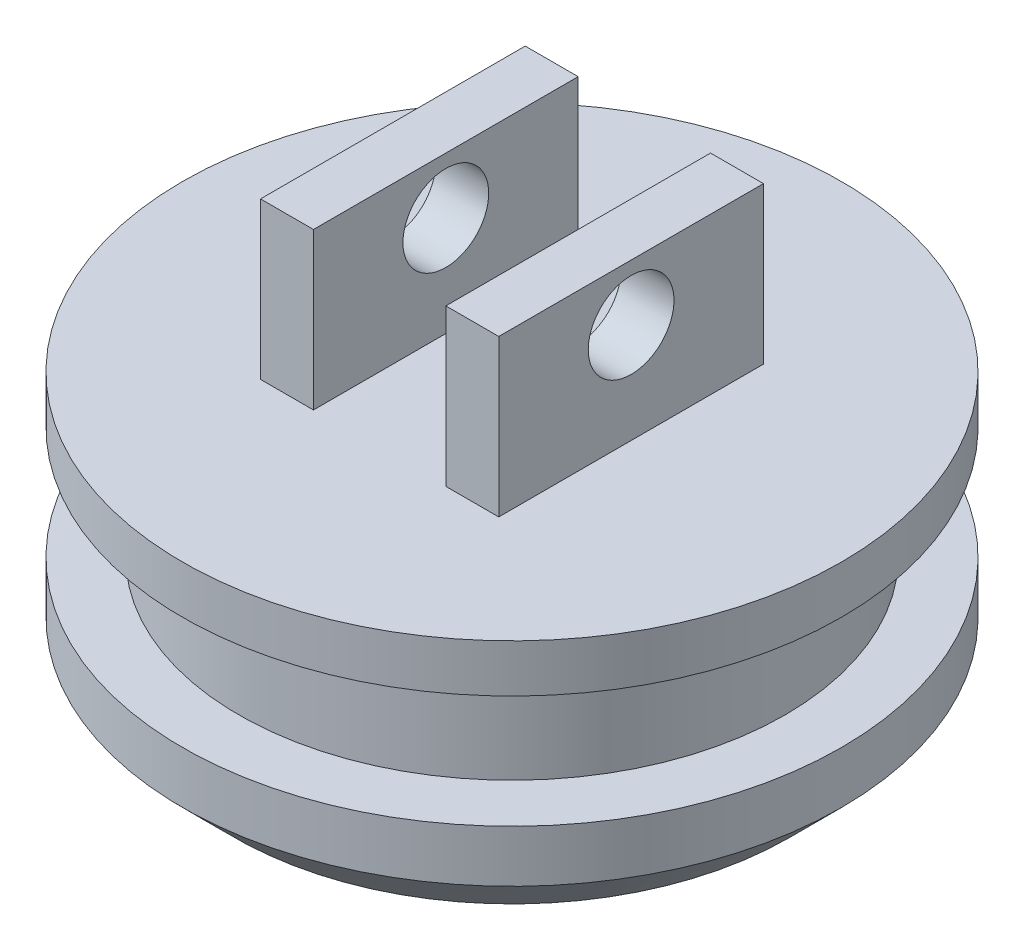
ISO-10303-21;
HEADER;
FILE_DESCRIPTION(('STEP AP214'),'2;1');
FILE_NAME('part.step','',(''),(''),'','','');
FILE_SCHEMA(('AUTOMOTIVE_DESIGN { 1 0 10303 214 1 1 1 1 }'));
ENDSEC;
DATA;
#1=APPLICATION_CONTEXT('core data for automotive mechanical design processes');
#2=APPLICATION_PROTOCOL_DEFINITION('international standard','automotive_design',2000,#1);
#3=PRODUCT_CONTEXT('',#1,'mechanical');
#4=PRODUCT('Part','Part','',(#3));
#5=PRODUCT_RELATED_PRODUCT_CATEGORY('part','',(#4));
#6=PRODUCT_DEFINITION_FORMATION('','',#4);
#7=PRODUCT_DEFINITION_CONTEXT('part definition',#1,'design');
#8=PRODUCT_DEFINITION('design','',#6,#7);
#9=PRODUCT_DEFINITION_SHAPE('','',#8);
#10=(LENGTH_UNIT() NAMED_UNIT(*) SI_UNIT(.MILLI.,.METRE.));
#11=(NAMED_UNIT(*) PLANE_ANGLE_UNIT() SI_UNIT($,.RADIAN.));
#12=(NAMED_UNIT(*) SI_UNIT($,.STERADIAN.) SOLID_ANGLE_UNIT());
#13=UNCERTAINTY_MEASURE_WITH_UNIT(LENGTH_MEASURE(1.E-05),#10,'distance_accuracy_value','');
#14=(GEOMETRIC_REPRESENTATION_CONTEXT(3) GLOBAL_UNCERTAINTY_ASSIGNED_CONTEXT((#13)) GLOBAL_UNIT_ASSIGNED_CONTEXT((#10,
#11,#12)) REPRESENTATION_CONTEXT('',''));
#15=CARTESIAN_POINT('',(0.,0.,0.));
#16=DIRECTION('',(0.,0.,1.));
#17=DIRECTION('',(1.,0.,0.));
#18=AXIS2_PLACEMENT_3D('',#15,#16,#17);
#19=CARTESIAN_POINT('',(5.715,11.7920074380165,-6.35));
#20=DIRECTION('',(1.,0.,0.));
#21=DIRECTION('',(0.,0.,-1.));
#22=AXIS2_PLACEMENT_3D('',#19,#20,#21);
#23=PLANE('',#22);
#24=DIRECTION('',(0.,0.,1.));
#25=VECTOR('',#24,1.);
#26=CARTESIAN_POINT('',(5.715,4.29200743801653,-6.35));
#27=LINE('',#26,#25);
#28=CARTESIAN_POINT('',(5.715,4.29200743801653,-6.35));
#29=VERTEX_POINT('',#28);
#30=CARTESIAN_POINT('',(5.715,4.29200743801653,6.35));
#31=VERTEX_POINT('',#30);
#32=EDGE_CURVE('E104',#29,#31,#27,.T.);
#33=ORIENTED_EDGE('',*,*,#32,.F.);
#34=DIRECTION('',(0.,-1.,0.));
#35=VECTOR('',#34,1.);
#36=CARTESIAN_POINT('',(5.715,11.7920074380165,-6.35));
#37=LINE('',#36,#35);
#38=CARTESIAN_POINT('',(5.715,11.7920074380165,-6.35));
#39=VERTEX_POINT('',#38);
#40=EDGE_CURVE('E98',#39,#29,#37,.T.);
#41=ORIENTED_EDGE('',*,*,#40,.F.);
#42=DIRECTION('',(0.,0.,1.));
#43=VECTOR('',#42,1.);
#44=CARTESIAN_POINT('',(5.715,11.7920074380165,-6.35));
#45=LINE('',#44,#43);
#46=CARTESIAN_POINT('',(5.715,11.7920074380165,6.35));
#47=VERTEX_POINT('',#46);
#48=EDGE_CURVE('E101',#39,#47,#45,.T.);
#49=ORIENTED_EDGE('',*,*,#48,.T.);
#50=DIRECTION('',(0.,-1.,0.));
#51=VECTOR('',#50,1.);
#52=CARTESIAN_POINT('',(5.715,11.7920074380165,6.35));
#53=LINE('',#52,#51);
#54=EDGE_CURVE('E129',#47,#31,#53,.T.);
#55=ORIENTED_EDGE('',*,*,#54,.T.);
#56=EDGE_LOOP('',(#33,#41,#49,#55));
#57=FACE_BOUND('',#56,.T.);
#58=CARTESIAN_POINT('',(5.715,9.09400743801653,0.));
#59=DIRECTION('',(-1.,0.,0.));
#60=DIRECTION('',(0.,0.,1.));
#61=AXIS2_PLACEMENT_3D('',#58,#59,#60);
#62=CIRCLE('',#61,2.0574);
#63=CARTESIAN_POINT('',(5.715,9.09400743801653,2.0574));
#64=VERTEX_POINT('',#63);
#65=EDGE_CURVE('E192',#64,#64,#62,.T.);
#66=ORIENTED_EDGE('',*,*,#65,.T.);
#67=EDGE_LOOP('',(#66));
#68=FACE_BOUND('',#67,.T.);
#69=ADVANCED_FACE('F33',(#57,#68),#23,.T.);
#70=CARTESIAN_POINT('',(3.175,11.7920074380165,-6.35));
#71=DIRECTION('',(-1.,0.,0.));
#72=DIRECTION('',(0.,0.,1.));
#73=AXIS2_PLACEMENT_3D('',#70,#71,#72);
#74=PLANE('',#73);
#75=DIRECTION('',(0.,0.,-1.));
#76=VECTOR('',#75,1.);
#77=CARTESIAN_POINT('',(3.175,4.29200743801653,-6.35));
#78=LINE('',#77,#76);
#79=CARTESIAN_POINT('',(3.175,4.29200743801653,6.35));
#80=VERTEX_POINT('',#79);
#81=CARTESIAN_POINT('',(3.175,4.29200743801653,-6.35));
#82=VERTEX_POINT('',#81);
#83=EDGE_CURVE('E48',#80,#82,#78,.T.);
#84=ORIENTED_EDGE('',*,*,#83,.F.);
#85=DIRECTION('',(0.,-1.,0.));
#86=VECTOR('',#85,1.);
#87=CARTESIAN_POINT('',(3.175,11.7920074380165,6.35));
#88=LINE('',#87,#86);
#89=CARTESIAN_POINT('',(3.175,11.7920074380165,6.35));
#90=VERTEX_POINT('',#89);
#91=EDGE_CURVE('E138',#90,#80,#88,.T.);
#92=ORIENTED_EDGE('',*,*,#91,.F.);
#93=DIRECTION('',(0.,0.,-1.));
#94=VECTOR('',#93,1.);
#95=CARTESIAN_POINT('',(3.175,11.7920074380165,-6.35));
#96=LINE('',#95,#94);
#97=CARTESIAN_POINT('',(3.175,11.7920074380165,-6.35));
#98=VERTEX_POINT('',#97);
#99=EDGE_CURVE('E123',#90,#98,#96,.T.);
#100=ORIENTED_EDGE('',*,*,#99,.T.);
#101=DIRECTION('',(0.,-1.,0.));
#102=VECTOR('',#101,1.);
#103=CARTESIAN_POINT('',(3.175,11.7920074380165,-6.35));
#104=LINE('',#103,#102);
#105=EDGE_CURVE('E110',#98,#82,#104,.T.);
#106=ORIENTED_EDGE('',*,*,#105,.T.);
#107=EDGE_LOOP('',(#84,#92,#100,#106));
#108=FACE_BOUND('',#107,.T.);
#109=CARTESIAN_POINT('',(3.175,9.09400743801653,0.));
#110=DIRECTION('',(-1.,0.,0.));
#111=DIRECTION('',(0.,0.,1.));
#112=AXIS2_PLACEMENT_3D('',#109,#110,#111);
#113=CIRCLE('',#112,2.0574);
#114=CARTESIAN_POINT('',(3.175,9.09400743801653,2.0574));
#115=VERTEX_POINT('',#114);
#116=EDGE_CURVE('E132',#115,#115,#113,.F.);
#117=ORIENTED_EDGE('',*,*,#116,.T.);
#118=EDGE_LOOP('',(#117));
#119=FACE_BOUND('',#118,.T.);
#120=ADVANCED_FACE('F208',(#108,#119),#74,.T.);
#121=CARTESIAN_POINT('',(0.,4.29200743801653,0.));
#122=DIRECTION('',(0.,-1.,0.));
#123=DIRECTION('',(1.,0.,0.));
#124=AXIS2_PLACEMENT_3D('',#121,#122,#123);
#125=PLANE('',#124);
#126=DIRECTION('',(1.,0.,0.));
#127=VECTOR('',#126,1.);
#128=CARTESIAN_POINT('',(5.715,4.29200743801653,-6.35));
#129=LINE('',#128,#127);
#130=EDGE_CURVE('E131',#82,#29,#129,.T.);
#131=ORIENTED_EDGE('',*,*,#130,.T.);
#132=ORIENTED_EDGE('',*,*,#32,.T.);
#133=DIRECTION('',(-1.,0.,0.));
#134=VECTOR('',#133,1.);
#135=CARTESIAN_POINT('',(5.715,4.29200743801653,6.35));
#136=LINE('',#135,#134);
#137=EDGE_CURVE('E120',#31,#80,#136,.T.);
#138=ORIENTED_EDGE('',*,*,#137,.T.);
#139=ORIENTED_EDGE('',*,*,#83,.T.);
#140=EDGE_LOOP('',(#131,#132,#138,#139));
#141=FACE_BOUND('',#140,.T.);
#142=CARTESIAN_POINT('',(0.,4.29200743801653,0.));
#143=DIRECTION('',(0.,-1.,0.));
#144=DIRECTION('',(1.,0.,0.));
#145=AXIS2_PLACEMENT_3D('',#142,#143,#144);
#146=CIRCLE('',#145,15.8115);
#147=CARTESIAN_POINT('',(15.8115,4.29200743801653,0.));
#148=VERTEX_POINT('',#147);
#149=EDGE_CURVE('E186',#148,#148,#146,.T.);
#150=ORIENTED_EDGE('',*,*,#149,.F.);
#151=EDGE_LOOP('',(#150));
#152=FACE_BOUND('',#151,.T.);
#153=DIRECTION('',(0.,0.,1.));
#154=VECTOR('',#153,1.);
#155=CARTESIAN_POINT('',(-5.715,4.29200743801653,-6.35));
#156=LINE('',#155,#154);
#157=CARTESIAN_POINT('',(-5.715,4.29200743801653,-6.35));
#158=VERTEX_POINT('',#157);
#159=CARTESIAN_POINT('',(-5.715,4.29200743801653,6.35));
#160=VERTEX_POINT('',#159);
#161=EDGE_CURVE('E155',#158,#160,#156,.T.);
#162=ORIENTED_EDGE('',*,*,#161,.F.);
#163=DIRECTION('',(-1.,0.,0.));
#164=VECTOR('',#163,1.);
#165=CARTESIAN_POINT('',(-5.715,4.29200743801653,-6.35));
#166=LINE('',#165,#164);
#167=CARTESIAN_POINT('',(-3.175,4.29200743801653,-6.35));
#168=VERTEX_POINT('',#167);
#169=EDGE_CURVE('E148',#168,#158,#166,.T.);
#170=ORIENTED_EDGE('',*,*,#169,.F.);
#171=DIRECTION('',(0.,0.,-1.));
#172=VECTOR('',#171,1.);
#173=CARTESIAN_POINT('',(-3.175,4.29200743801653,-6.35));
#174=LINE('',#173,#172);
#175=CARTESIAN_POINT('',(-3.175,4.29200743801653,6.35));
#176=VERTEX_POINT('',#175);
#177=EDGE_CURVE('E159',#176,#168,#174,.T.);
#178=ORIENTED_EDGE('',*,*,#177,.F.);
#179=DIRECTION('',(1.,0.,0.));
#180=VECTOR('',#179,1.);
#181=CARTESIAN_POINT('',(-5.715,4.29200743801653,6.35));
#182=LINE('',#181,#180);
#183=EDGE_CURVE('E56',#160,#176,#182,.T.);
#184=ORIENTED_EDGE('',*,*,#183,.F.);
#185=EDGE_LOOP('',(#162,#170,#178,#184));
#186=FACE_BOUND('',#185,.T.);
#187=ADVANCED_FACE('F213',(#141,#152,#186),#125,.F.);
#188=CARTESIAN_POINT('',(0.,-8.40799256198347,0.));
#189=DIRECTION('',(0.,-1.,0.));
#190=DIRECTION('',(1.,0.,0.));
#191=AXIS2_PLACEMENT_3D('',#188,#189,#190);
#192=CYLINDRICAL_SURFACE('',#191,15.8115);
#193=CARTESIAN_POINT('',(0.,1.99710743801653,0.));
#194=DIRECTION('',(0.,-1.,0.));
#195=DIRECTION('',(1.,0.,0.));
#196=AXIS2_PLACEMENT_3D('',#193,#194,#195);
#197=CIRCLE('',#196,15.8115);
#198=CARTESIAN_POINT('',(15.8115,1.99710743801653,0.));
#199=VERTEX_POINT('',#198);
#200=EDGE_CURVE('E183',#199,#199,#197,.T.);
#201=ORIENTED_EDGE('',*,*,#200,.F.);
#202=EDGE_LOOP('',(#201));
#203=FACE_BOUND('',#202,.T.);
#204=ORIENTED_EDGE('',*,*,#149,.T.);
#205=EDGE_LOOP('',(#204));
#206=FACE_BOUND('',#205,.T.);
#207=ADVANCED_FACE('F258',(#203,#206),#192,.T.);
#208=CARTESIAN_POINT('',(-15.8115,1.99710743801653,0.));
#209=DIRECTION('',(0.,1.,0.));
#210=DIRECTION('',(-1.,0.,0.));
#211=AXIS2_PLACEMENT_3D('',#208,#209,#210);
#212=PLANE('',#211);
#213=CARTESIAN_POINT('',(0.,1.99710743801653,0.));
#214=DIRECTION('',(0.,-1.,0.));
#215=DIRECTION('',(1.,0.,0.));
#216=AXIS2_PLACEMENT_3D('',#213,#214,#215);
#217=CIRCLE('',#216,13.1064);
#218=CARTESIAN_POINT('',(13.1064,1.99710743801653,0.));
#219=VERTEX_POINT('',#218);
#220=EDGE_CURVE('E180',#219,#219,#217,.T.);
#221=ORIENTED_EDGE('',*,*,#220,.F.);
#222=EDGE_LOOP('',(#221));
#223=FACE_BOUND('',#222,.T.);
#224=ORIENTED_EDGE('',*,*,#200,.T.);
#225=EDGE_LOOP('',(#224));
#226=FACE_BOUND('',#225,.T.);
#227=ADVANCED_FACE('F254',(#223,#226),#212,.F.);
#228=CARTESIAN_POINT('',(0.,-8.40799256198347,0.));
#229=DIRECTION('',(0.,-1.,0.));
#230=DIRECTION('',(1.,0.,0.));
#231=AXIS2_PLACEMENT_3D('',#228,#229,#230);
#232=CYLINDRICAL_SURFACE('',#231,13.1064);
#233=CARTESIAN_POINT('',(0.,-3.41309256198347,0.));
#234=DIRECTION('',(0.,-1.,0.));
#235=DIRECTION('',(1.,0.,0.));
#236=AXIS2_PLACEMENT_3D('',#233,#234,#235);
#237=CIRCLE('',#236,13.1064);
#238=CARTESIAN_POINT('',(13.1064,-3.41309256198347,0.));
#239=VERTEX_POINT('',#238);
#240=EDGE_CURVE('E177',#239,#239,#237,.T.);
#241=ORIENTED_EDGE('',*,*,#240,.F.);
#242=EDGE_LOOP('',(#241));
#243=FACE_BOUND('',#242,.T.);
#244=ORIENTED_EDGE('',*,*,#220,.T.);
#245=EDGE_LOOP('',(#244));
#246=FACE_BOUND('',#245,.T.);
#247=ADVANCED_FACE('F250',(#243,#246),#232,.T.);
#248=CARTESIAN_POINT('',(-13.1064,-3.41309256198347,0.));
#249=DIRECTION('',(0.,-1.,0.));
#250=DIRECTION('',(1.,0.,0.));
#251=AXIS2_PLACEMENT_3D('',#248,#249,#250);
#252=PLANE('',#251);
#253=CARTESIAN_POINT('',(0.,-3.41309256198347,0.));
#254=DIRECTION('',(0.,-1.,0.));
#255=DIRECTION('',(1.,0.,0.));
#256=AXIS2_PLACEMENT_3D('',#253,#254,#255);
#257=CIRCLE('',#256,15.8115);
#258=CARTESIAN_POINT('',(15.8115,-3.41309256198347,0.));
#259=VERTEX_POINT('',#258);
#260=EDGE_CURVE('E174',#259,#259,#257,.T.);
#261=ORIENTED_EDGE('',*,*,#260,.F.);
#262=EDGE_LOOP('',(#261));
#263=FACE_BOUND('',#262,.T.);
#264=ORIENTED_EDGE('',*,*,#240,.T.);
#265=EDGE_LOOP('',(#264));
#266=FACE_BOUND('',#265,.T.);
#267=ADVANCED_FACE('F246',(#263,#266),#252,.F.);
#268=CARTESIAN_POINT('',(0.,-8.40799256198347,0.));
#269=DIRECTION('',(0.,-1.,0.));
#270=DIRECTION('',(1.,0.,0.));
#271=AXIS2_PLACEMENT_3D('',#268,#269,#270);
#272=CYLINDRICAL_SURFACE('',#271,15.8115);
#273=CARTESIAN_POINT('',(0.,-5.90799256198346,0.));
#274=DIRECTION('',(0.,1.,0.));
#275=DIRECTION('',(-1.,0.,0.));
#276=AXIS2_PLACEMENT_3D('',#273,#274,#275);
#277=CIRCLE('',#276,15.8115);
#278=CARTESIAN_POINT('',(-15.8115,-5.90799256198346,0.));
#279=VERTEX_POINT('',#278);
#280=EDGE_CURVE('E11',#279,#279,#277,.T.);
#281=ORIENTED_EDGE('',*,*,#280,.T.);
#282=EDGE_LOOP('',(#281));
#283=FACE_BOUND('',#282,.T.);
#284=ORIENTED_EDGE('',*,*,#260,.T.);
#285=EDGE_LOOP('',(#284));
#286=FACE_BOUND('',#285,.T.);
#287=ADVANCED_FACE('F243',(#283,#286),#272,.T.);
#288=CARTESIAN_POINT('',(-15.8115,-8.40799256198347,0.));
#289=DIRECTION('',(0.,1.,0.));
#290=DIRECTION('',(-1.,0.,0.));
#291=AXIS2_PLACEMENT_3D('',#288,#289,#290);
#292=PLANE('',#291);
#293=CARTESIAN_POINT('',(0.,-8.40799256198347,0.));
#294=DIRECTION('',(0.,1.,0.));
#295=DIRECTION('',(-1.,0.,0.));
#296=AXIS2_PLACEMENT_3D('',#293,#294,#295);
#297=CIRCLE('',#296,13.3115);
#298=CARTESIAN_POINT('',(-13.3115,-8.40799256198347,0.));
#299=VERTEX_POINT('',#298);
#300=EDGE_CURVE('E41',#299,#299,#297,.F.);
#301=ORIENTED_EDGE('',*,*,#300,.T.);
#302=EDGE_LOOP('',(#301));
#303=FACE_BOUND('',#302,.T.);
#304=ADVANCED_FACE('F196',(#303),#292,.F.);
#305=CARTESIAN_POINT('',(-5.715,11.7920074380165,-6.35));
#306=DIRECTION('',(1.,0.,0.));
#307=DIRECTION('',(0.,0.,-1.));
#308=AXIS2_PLACEMENT_3D('',#305,#306,#307);
#309=PLANE('',#308);
#310=CARTESIAN_POINT('',(-5.715,9.09400743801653,0.));
#311=DIRECTION('',(-1.,0.,0.));
#312=DIRECTION('',(0.,0.,1.));
#313=AXIS2_PLACEMENT_3D('',#310,#311,#312);
#314=CIRCLE('',#313,2.0574);
#315=CARTESIAN_POINT('',(-5.715,9.09400743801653,2.0574));
#316=VERTEX_POINT('',#315);
#317=EDGE_CURVE('E109',#316,#316,#314,.T.);
#318=ORIENTED_EDGE('',*,*,#317,.F.);
#319=EDGE_LOOP('',(#318));
#320=FACE_BOUND('',#319,.T.);
#321=ORIENTED_EDGE('',*,*,#161,.T.);
#322=DIRECTION('',(0.,-1.,0.));
#323=VECTOR('',#322,1.);
#324=CARTESIAN_POINT('',(-5.715,11.7920074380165,6.35));
#325=LINE('',#324,#323);
#326=CARTESIAN_POINT('',(-5.715,11.7920074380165,6.35));
#327=VERTEX_POINT('',#326);
#328=EDGE_CURVE('E172',#327,#160,#325,.T.);
#329=ORIENTED_EDGE('',*,*,#328,.F.);
#330=DIRECTION('',(0.,0.,1.));
#331=VECTOR('',#330,1.);
#332=CARTESIAN_POINT('',(-5.715,11.7920074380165,-6.35));
#333=LINE('',#332,#331);
#334=CARTESIAN_POINT('',(-5.715,11.7920074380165,-6.35));
#335=VERTEX_POINT('',#334);
#336=EDGE_CURVE('E144',#335,#327,#333,.T.);
#337=ORIENTED_EDGE('',*,*,#336,.F.);
#338=DIRECTION('',(0.,-1.,0.));
#339=VECTOR('',#338,1.);
#340=CARTESIAN_POINT('',(-5.715,11.7920074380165,-6.35));
#341=LINE('',#340,#339);
#342=EDGE_CURVE('E154',#335,#158,#341,.T.);
#343=ORIENTED_EDGE('',*,*,#342,.T.);
#344=EDGE_LOOP('',(#321,#329,#337,#343));
#345=FACE_BOUND('',#344,.T.);
#346=ADVANCED_FACE('F236',(#320,#345),#309,.F.);
#347=CARTESIAN_POINT('',(-5.715,11.7920074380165,6.35));
#348=DIRECTION('',(0.,0.,-1.));
#349=DIRECTION('',(-1.,0.,0.));
#350=AXIS2_PLACEMENT_3D('',#347,#348,#349);
#351=PLANE('',#350);
#352=ORIENTED_EDGE('',*,*,#183,.T.);
#353=DIRECTION('',(0.,-1.,0.));
#354=VECTOR('',#353,1.);
#355=CARTESIAN_POINT('',(-3.175,11.7920074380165,6.35));
#356=LINE('',#355,#354);
#357=CARTESIAN_POINT('',(-3.175,11.7920074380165,6.35));
#358=VERTEX_POINT('',#357);
#359=EDGE_CURVE('E169',#358,#176,#356,.T.);
#360=ORIENTED_EDGE('',*,*,#359,.F.);
#361=DIRECTION('',(1.,0.,0.));
#362=VECTOR('',#361,1.);
#363=CARTESIAN_POINT('',(-5.715,11.7920074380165,6.35));
#364=LINE('',#363,#362);
#365=EDGE_CURVE('E147',#327,#358,#364,.T.);
#366=ORIENTED_EDGE('',*,*,#365,.F.);
#367=ORIENTED_EDGE('',*,*,#328,.T.);
#368=EDGE_LOOP('',(#352,#360,#366,#367));
#369=FACE_BOUND('',#368,.T.);
#370=ADVANCED_FACE('F232',(#369),#351,.F.);
#371=CARTESIAN_POINT('',(-3.175,11.7920074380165,-6.35));
#372=DIRECTION('',(-1.,0.,0.));
#373=DIRECTION('',(0.,0.,1.));
#374=AXIS2_PLACEMENT_3D('',#371,#372,#373);
#375=PLANE('',#374);
#376=CARTESIAN_POINT('',(-3.175,9.09400743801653,0.));
#377=DIRECTION('',(-1.,0.,0.));
#378=DIRECTION('',(0.,0.,1.));
#379=AXIS2_PLACEMENT_3D('',#376,#377,#378);
#380=CIRCLE('',#379,2.0574);
#381=CARTESIAN_POINT('',(-3.175,9.09400743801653,2.0574));
#382=VERTEX_POINT('',#381);
#383=EDGE_CURVE('E143',#382,#382,#380,.T.);
#384=ORIENTED_EDGE('',*,*,#383,.T.);
#385=EDGE_LOOP('',(#384));
#386=FACE_BOUND('',#385,.T.);
#387=ORIENTED_EDGE('',*,*,#177,.T.);
#388=DIRECTION('',(0.,-1.,0.));
#389=VECTOR('',#388,1.);
#390=CARTESIAN_POINT('',(-3.175,11.7920074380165,-6.35));
#391=LINE('',#390,#389);
#392=CARTESIAN_POINT('',(-3.175,11.7920074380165,-6.35));
#393=VERTEX_POINT('',#392);
#394=EDGE_CURVE('E166',#393,#168,#391,.T.);
#395=ORIENTED_EDGE('',*,*,#394,.F.);
#396=DIRECTION('',(0.,0.,-1.));
#397=VECTOR('',#396,1.);
#398=CARTESIAN_POINT('',(-3.175,11.7920074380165,-6.35));
#399=LINE('',#398,#397);
#400=EDGE_CURVE('E150',#358,#393,#399,.T.);
#401=ORIENTED_EDGE('',*,*,#400,.F.);
#402=ORIENTED_EDGE('',*,*,#359,.T.);
#403=EDGE_LOOP('',(#387,#395,#401,#402));
#404=FACE_BOUND('',#403,.T.);
#405=ADVANCED_FACE('F228',(#386,#404),#375,.F.);
#406=CARTESIAN_POINT('',(-5.715,11.7920074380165,-6.35));
#407=DIRECTION('',(0.,0.,1.));
#408=DIRECTION('',(1.,0.,0.));
#409=AXIS2_PLACEMENT_3D('',#406,#407,#408);
#410=PLANE('',#409);
#411=ORIENTED_EDGE('',*,*,#169,.T.);
#412=ORIENTED_EDGE('',*,*,#342,.F.);
#413=DIRECTION('',(-1.,0.,0.));
#414=VECTOR('',#413,1.);
#415=CARTESIAN_POINT('',(-5.715,11.7920074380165,-6.35));
#416=LINE('',#415,#414);
#417=EDGE_CURVE('E152',#393,#335,#416,.T.);
#418=ORIENTED_EDGE('',*,*,#417,.F.);
#419=ORIENTED_EDGE('',*,*,#394,.T.);
#420=EDGE_LOOP('',(#411,#412,#418,#419));
#421=FACE_BOUND('',#420,.T.);
#422=ADVANCED_FACE('F224',(#421),#410,.F.);
#423=CARTESIAN_POINT('',(0.,11.7920074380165,0.));
#424=DIRECTION('',(0.,1.,0.));
#425=DIRECTION('',(-1.,0.,0.));
#426=AXIS2_PLACEMENT_3D('',#423,#424,#425);
#427=PLANE('',#426);
#428=ORIENTED_EDGE('',*,*,#336,.T.);
#429=ORIENTED_EDGE('',*,*,#365,.T.);
#430=ORIENTED_EDGE('',*,*,#400,.T.);
#431=ORIENTED_EDGE('',*,*,#417,.T.);
#432=EDGE_LOOP('',(#428,#429,#430,#431));
#433=FACE_BOUND('',#432,.T.);
#434=ADVANCED_FACE('F220',(#433),#427,.T.);
#435=CARTESIAN_POINT('',(4.285,9.09400743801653,0.));
#436=DIRECTION('',(-1.,0.,0.));
#437=DIRECTION('',(0.,0.,1.));
#438=AXIS2_PLACEMENT_3D('',#435,#436,#437);
#439=CYLINDRICAL_SURFACE('',#438,2.0574);
#440=ORIENTED_EDGE('',*,*,#383,.F.);
#441=EDGE_LOOP('',(#440));
#442=FACE_BOUND('',#441,.T.);
#443=ORIENTED_EDGE('',*,*,#317,.T.);
#444=EDGE_LOOP('',(#443));
#445=FACE_BOUND('',#444,.T.);
#446=ADVANCED_FACE('F217',(#442,#445),#439,.F.);
#447=CARTESIAN_POINT('',(5.715,11.7920074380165,-6.35));
#448=DIRECTION('',(0.,0.,-1.));
#449=DIRECTION('',(-1.,0.,0.));
#450=AXIS2_PLACEMENT_3D('',#447,#448,#449);
#451=PLANE('',#450);
#452=ORIENTED_EDGE('',*,*,#130,.F.);
#453=ORIENTED_EDGE('',*,*,#105,.F.);
#454=DIRECTION('',(1.,0.,0.));
#455=VECTOR('',#454,1.);
#456=CARTESIAN_POINT('',(5.715,11.7920074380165,-6.35));
#457=LINE('',#456,#455);
#458=EDGE_CURVE('E116',#98,#39,#457,.T.);
#459=ORIENTED_EDGE('',*,*,#458,.T.);
#460=ORIENTED_EDGE('',*,*,#40,.T.);
#461=EDGE_LOOP('',(#452,#453,#459,#460));
#462=FACE_BOUND('',#461,.T.);
#463=ADVANCED_FACE('F122',(#462),#451,.T.);
#464=CARTESIAN_POINT('',(5.715,11.7920074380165,6.35));
#465=DIRECTION('',(0.,0.,1.));
#466=DIRECTION('',(1.,0.,0.));
#467=AXIS2_PLACEMENT_3D('',#464,#465,#466);
#468=PLANE('',#467);
#469=ORIENTED_EDGE('',*,*,#137,.F.);
#470=ORIENTED_EDGE('',*,*,#54,.F.);
#471=DIRECTION('',(-1.,0.,0.));
#472=VECTOR('',#471,1.);
#473=CARTESIAN_POINT('',(5.715,11.7920074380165,6.35));
#474=LINE('',#473,#472);
#475=EDGE_CURVE('E119',#47,#90,#474,.T.);
#476=ORIENTED_EDGE('',*,*,#475,.T.);
#477=ORIENTED_EDGE('',*,*,#91,.T.);
#478=EDGE_LOOP('',(#469,#470,#476,#477));
#479=FACE_BOUND('',#478,.T.);
#480=ADVANCED_FACE('F280',(#479),#468,.T.);
#481=CARTESIAN_POINT('',(0.,11.7920074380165,0.));
#482=DIRECTION('',(0.,1.,0.));
#483=DIRECTION('',(1.,0.,0.));
#484=AXIS2_PLACEMENT_3D('',#481,#482,#483);
#485=PLANE('',#484);
#486=ORIENTED_EDGE('',*,*,#48,.F.);
#487=ORIENTED_EDGE('',*,*,#458,.F.);
#488=ORIENTED_EDGE('',*,*,#99,.F.);
#489=ORIENTED_EDGE('',*,*,#475,.F.);
#490=EDGE_LOOP('',(#486,#487,#488,#489));
#491=FACE_BOUND('',#490,.T.);
#492=ADVANCED_FACE('F114',(#491),#485,.T.);
#493=CARTESIAN_POINT('',(-4.285,9.09400743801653,0.));
#494=DIRECTION('',(1.,0.,0.));
#495=DIRECTION('',(0.,0.,-1.));
#496=AXIS2_PLACEMENT_3D('',#493,#494,#495);
#497=CYLINDRICAL_SURFACE('',#496,2.0574);
#498=ORIENTED_EDGE('',*,*,#116,.F.);
#499=EDGE_LOOP('',(#498));
#500=FACE_BOUND('',#499,.T.);
#501=ORIENTED_EDGE('',*,*,#65,.F.);
#502=EDGE_LOOP('',(#501));
#503=FACE_BOUND('',#502,.T.);
#504=ADVANCED_FACE('F199',(#500,#503),#497,.F.);
#505=CARTESIAN_POINT('',(0.,-8.40799256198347,0.));
#506=DIRECTION('',(0.,1.,0.));
#507=DIRECTION('',(-1.,0.,0.));
#508=AXIS2_PLACEMENT_3D('',#505,#506,#507);
#509=CONICAL_SURFACE('',#508,13.3115,0.785398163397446);
#510=ORIENTED_EDGE('',*,*,#280,.F.);
#511=EDGE_LOOP('',(#510));
#512=FACE_BOUND('',#511,.T.);
#513=ORIENTED_EDGE('',*,*,#300,.F.);
#514=EDGE_LOOP('',(#513));
#515=FACE_BOUND('',#514,.T.);
#516=ADVANCED_FACE('F35',(#512,#515),#509,.T.);
#517=CLOSED_SHELL('',(#69,#120,#187,#207,#227,#247,#267,#287,#304,#346,#370,#405,#422,#434,#446,
#463,#480,#492,#504,#516));
#518=MANIFOLD_SOLID_BREP('B2',#517);
#519=ADVANCED_BREP_SHAPE_REPRESENTATION('',(#18,#518),#14);
#520=SHAPE_DEFINITION_REPRESENTATION(#9,#519);
ENDSEC;
END-ISO-10303-21;
